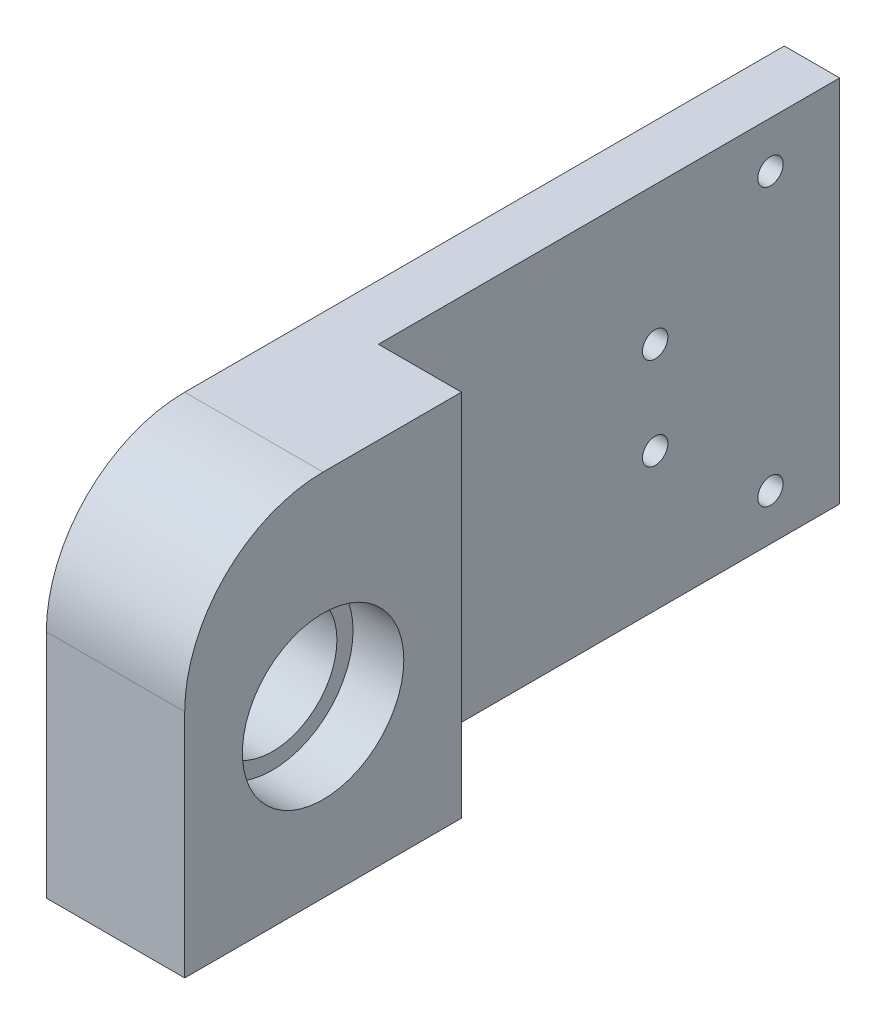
ISO-10303-21;
HEADER;
FILE_DESCRIPTION(('STEP AP214'),'2;1');
FILE_NAME('part.step','',(''),(''),'','','');
FILE_SCHEMA(('AUTOMOTIVE_DESIGN { 1 0 10303 214 1 1 1 1 }'));
ENDSEC;
DATA;
#1=APPLICATION_CONTEXT('core data for automotive mechanical design processes');
#2=APPLICATION_PROTOCOL_DEFINITION('international standard','automotive_design',2000,#1);
#3=PRODUCT_CONTEXT('',#1,'mechanical');
#4=PRODUCT('Part','Part','',(#3));
#5=PRODUCT_RELATED_PRODUCT_CATEGORY('part','',(#4));
#6=PRODUCT_DEFINITION_FORMATION('','',#4);
#7=PRODUCT_DEFINITION_CONTEXT('part definition',#1,'design');
#8=PRODUCT_DEFINITION('design','',#6,#7);
#9=PRODUCT_DEFINITION_SHAPE('','',#8);
#10=(LENGTH_UNIT() NAMED_UNIT(*) SI_UNIT(.MILLI.,.METRE.));
#11=(NAMED_UNIT(*) PLANE_ANGLE_UNIT() SI_UNIT($,.RADIAN.));
#12=(NAMED_UNIT(*) SI_UNIT($,.STERADIAN.) SOLID_ANGLE_UNIT());
#13=UNCERTAINTY_MEASURE_WITH_UNIT(LENGTH_MEASURE(1.E-05),#10,'distance_accuracy_value','');
#14=(GEOMETRIC_REPRESENTATION_CONTEXT(3) GLOBAL_UNCERTAINTY_ASSIGNED_CONTEXT((#13)) GLOBAL_UNIT_ASSIGNED_CONTEXT((#10,
#11,#12)) REPRESENTATION_CONTEXT('',''));
#15=CARTESIAN_POINT('',(0.,0.,0.));
#16=DIRECTION('',(0.,0.,1.));
#17=DIRECTION('',(1.,0.,0.));
#18=AXIS2_PLACEMENT_3D('',#15,#16,#17);
#19=CARTESIAN_POINT('',(0.,-30.,-65.));
#20=DIRECTION('',(1.,0.,0.));
#21=DIRECTION('',(0.,0.,-1.));
#22=AXIS2_PLACEMENT_3D('',#19,#20,#21);
#23=CYLINDRICAL_SURFACE('',#22,2.75000000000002);
#24=CARTESIAN_POINT('',(5.,-30.,-65.));
#25=DIRECTION('',(1.,0.,0.));
#26=DIRECTION('',(0.,0.,-1.));
#27=AXIS2_PLACEMENT_3D('',#24,#25,#26);
#28=CIRCLE('',#27,2.75000000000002);
#29=CARTESIAN_POINT('',(5.,-30.,-67.75));
#30=VERTEX_POINT('',#29);
#31=EDGE_CURVE('E20',#30,#30,#28,.T.);
#32=ORIENTED_EDGE('',*,*,#31,.F.);
#33=EDGE_LOOP('',(#32));
#34=FACE_BOUND('',#33,.T.);
#35=CARTESIAN_POINT('',(12.,-30.,-65.));
#36=DIRECTION('',(1.,0.,0.));
#37=DIRECTION('',(0.,0.,-1.));
#38=AXIS2_PLACEMENT_3D('',#35,#36,#37);
#39=CIRCLE('',#38,2.75000000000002);
#40=CARTESIAN_POINT('',(12.,-30.,-67.75));
#41=VERTEX_POINT('',#40);
#42=EDGE_CURVE('E207',#41,#41,#39,.T.);
#43=ORIENTED_EDGE('',*,*,#42,.T.);
#44=EDGE_LOOP('',(#43));
#45=FACE_BOUND('',#44,.T.);
#46=ADVANCED_FACE('F17',(#34,#45),#23,.F.);
#47=CARTESIAN_POINT('',(0.,-9.99999999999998,-40.));
#48=DIRECTION('',(1.,0.,0.));
#49=DIRECTION('',(0.,0.,-1.));
#50=AXIS2_PLACEMENT_3D('',#47,#48,#49);
#51=CYLINDRICAL_SURFACE('',#50,2.75);
#52=CARTESIAN_POINT('',(5.,-9.99999999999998,-40.));
#53=DIRECTION('',(1.,0.,0.));
#54=DIRECTION('',(0.,0.,-1.));
#55=AXIS2_PLACEMENT_3D('',#52,#53,#54);
#56=CIRCLE('',#55,2.75);
#57=CARTESIAN_POINT('',(5.,-9.99999999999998,-42.75));
#58=VERTEX_POINT('',#57);
#59=EDGE_CURVE('E218',#58,#58,#56,.T.);
#60=ORIENTED_EDGE('',*,*,#59,.F.);
#61=EDGE_LOOP('',(#60));
#62=FACE_BOUND('',#61,.T.);
#63=CARTESIAN_POINT('',(12.,-9.99999999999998,-40.));
#64=DIRECTION('',(1.,0.,0.));
#65=DIRECTION('',(0.,0.,-1.));
#66=AXIS2_PLACEMENT_3D('',#63,#64,#65);
#67=CIRCLE('',#66,2.75);
#68=CARTESIAN_POINT('',(12.,-9.99999999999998,-42.75));
#69=VERTEX_POINT('',#68);
#70=EDGE_CURVE('E204',#69,#69,#67,.T.);
#71=ORIENTED_EDGE('',*,*,#70,.T.);
#72=EDGE_LOOP('',(#71));
#73=FACE_BOUND('',#72,.T.);
#74=ADVANCED_FACE('F230',(#62,#73),#51,.F.);
#75=CARTESIAN_POINT('',(0.,9.99999999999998,-40.));
#76=DIRECTION('',(1.,0.,0.));
#77=DIRECTION('',(0.,0.,-1.));
#78=AXIS2_PLACEMENT_3D('',#75,#76,#77);
#79=CYLINDRICAL_SURFACE('',#78,2.75);
#80=CARTESIAN_POINT('',(5.,9.99999999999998,-40.));
#81=DIRECTION('',(1.,0.,0.));
#82=DIRECTION('',(0.,0.,-1.));
#83=AXIS2_PLACEMENT_3D('',#80,#81,#82);
#84=CIRCLE('',#83,2.75);
#85=CARTESIAN_POINT('',(5.,9.99999999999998,-42.75));
#86=VERTEX_POINT('',#85);
#87=EDGE_CURVE('E216',#86,#86,#84,.T.);
#88=ORIENTED_EDGE('',*,*,#87,.F.);
#89=EDGE_LOOP('',(#88));
#90=FACE_BOUND('',#89,.T.);
#91=CARTESIAN_POINT('',(12.,9.99999999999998,-40.));
#92=DIRECTION('',(1.,0.,0.));
#93=DIRECTION('',(0.,0.,-1.));
#94=AXIS2_PLACEMENT_3D('',#91,#92,#93);
#95=CIRCLE('',#94,2.75);
#96=CARTESIAN_POINT('',(12.,9.99999999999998,-42.75));
#97=VERTEX_POINT('',#96);
#98=EDGE_CURVE('E201',#97,#97,#95,.T.);
#99=ORIENTED_EDGE('',*,*,#98,.T.);
#100=EDGE_LOOP('',(#99));
#101=FACE_BOUND('',#100,.T.);
#102=ADVANCED_FACE('F323',(#90,#101),#79,.F.);
#103=CARTESIAN_POINT('',(0.,30.,-65.));
#104=DIRECTION('',(1.,0.,0.));
#105=DIRECTION('',(0.,0.,-1.));
#106=AXIS2_PLACEMENT_3D('',#103,#104,#105);
#107=CYLINDRICAL_SURFACE('',#106,2.75000000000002);
#108=CARTESIAN_POINT('',(5.,30.,-65.));
#109=DIRECTION('',(1.,0.,0.));
#110=DIRECTION('',(0.,0.,-1.));
#111=AXIS2_PLACEMENT_3D('',#108,#109,#110);
#112=CIRCLE('',#111,2.75000000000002);
#113=CARTESIAN_POINT('',(5.,30.,-67.75));
#114=VERTEX_POINT('',#113);
#115=EDGE_CURVE('E213',#114,#114,#112,.T.);
#116=ORIENTED_EDGE('',*,*,#115,.F.);
#117=EDGE_LOOP('',(#116));
#118=FACE_BOUND('',#117,.T.);
#119=CARTESIAN_POINT('',(12.,30.,-65.));
#120=DIRECTION('',(1.,0.,0.));
#121=DIRECTION('',(0.,0.,-1.));
#122=AXIS2_PLACEMENT_3D('',#119,#120,#121);
#123=CIRCLE('',#122,2.75000000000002);
#124=CARTESIAN_POINT('',(12.,30.,-67.75));
#125=VERTEX_POINT('',#124);
#126=EDGE_CURVE('E152',#125,#125,#123,.T.);
#127=ORIENTED_EDGE('',*,*,#126,.T.);
#128=EDGE_LOOP('',(#127));
#129=FACE_BOUND('',#128,.T.);
#130=ADVANCED_FACE('F311',(#118,#129),#107,.F.);
#131=CARTESIAN_POINT('',(19.,-4.00000000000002,50.));
#132=DIRECTION('',(1.,0.,0.));
#133=DIRECTION('',(0.,0.,-1.));
#134=AXIS2_PLACEMENT_3D('',#131,#132,#133);
#135=CYLINDRICAL_SURFACE('',#134,17.5);
#136=CARTESIAN_POINT('',(30.,-4.00000000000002,50.));
#137=DIRECTION('',(1.,0.,0.));
#138=DIRECTION('',(0.,0.,-1.));
#139=AXIS2_PLACEMENT_3D('',#136,#137,#138);
#140=CIRCLE('',#139,17.5);
#141=CARTESIAN_POINT('',(30.,-4.00000000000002,32.5));
#142=VERTEX_POINT('',#141);
#143=EDGE_CURVE('E145',#142,#142,#140,.F.);
#144=ORIENTED_EDGE('',*,*,#143,.F.);
#145=EDGE_LOOP('',(#144));
#146=FACE_BOUND('',#145,.T.);
#147=CARTESIAN_POINT('',(19.,-4.00000000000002,50.));
#148=DIRECTION('',(1.,0.,0.));
#149=DIRECTION('',(0.,0.,-1.));
#150=AXIS2_PLACEMENT_3D('',#147,#148,#149);
#151=CIRCLE('',#150,17.5);
#152=CARTESIAN_POINT('',(19.,-4.00000000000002,32.5));
#153=VERTEX_POINT('',#152);
#154=EDGE_CURVE('E210',#153,#153,#151,.T.);
#155=ORIENTED_EDGE('',*,*,#154,.F.);
#156=EDGE_LOOP('',(#155));
#157=FACE_BOUND('',#156,.T.);
#158=ADVANCED_FACE('F308',(#146,#157),#135,.F.);
#159=CARTESIAN_POINT('',(5.,-30.,-65.));
#160=DIRECTION('',(-1.,0.,0.));
#161=DIRECTION('',(0.,0.,1.));
#162=AXIS2_PLACEMENT_3D('',#159,#160,#161);
#163=PLANE('',#162);
#164=ORIENTED_EDGE('',*,*,#31,.T.);
#165=EDGE_LOOP('',(#164));
#166=FACE_BOUND('',#165,.T.);
#167=CARTESIAN_POINT('',(5.,-30.,-65.));
#168=DIRECTION('',(-1.,0.,0.));
#169=DIRECTION('',(0.,0.,1.));
#170=AXIS2_PLACEMENT_3D('',#167,#168,#169);
#171=CIRCLE('',#170,5.);
#172=CARTESIAN_POINT('',(5.,-30.,-60.));
#173=VERTEX_POINT('',#172);
#174=EDGE_CURVE('E194',#173,#173,#171,.T.);
#175=ORIENTED_EDGE('',*,*,#174,.T.);
#176=EDGE_LOOP('',(#175));
#177=FACE_BOUND('',#176,.T.);
#178=ADVANCED_FACE('F225',(#166,#177),#163,.T.);
#179=CARTESIAN_POINT('',(5.,-9.99999999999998,-40.));
#180=DIRECTION('',(-1.,0.,0.));
#181=DIRECTION('',(0.,0.,1.));
#182=AXIS2_PLACEMENT_3D('',#179,#180,#181);
#183=PLANE('',#182);
#184=ORIENTED_EDGE('',*,*,#59,.T.);
#185=EDGE_LOOP('',(#184));
#186=FACE_BOUND('',#185,.T.);
#187=CARTESIAN_POINT('',(5.,-9.99999999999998,-40.));
#188=DIRECTION('',(-1.,0.,0.));
#189=DIRECTION('',(0.,0.,1.));
#190=AXIS2_PLACEMENT_3D('',#187,#188,#189);
#191=CIRCLE('',#190,5.);
#192=CARTESIAN_POINT('',(5.,-9.99999999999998,-35.));
#193=VERTEX_POINT('',#192);
#194=EDGE_CURVE('E191',#193,#193,#191,.T.);
#195=ORIENTED_EDGE('',*,*,#194,.T.);
#196=EDGE_LOOP('',(#195));
#197=FACE_BOUND('',#196,.T.);
#198=ADVANCED_FACE('F321',(#186,#197),#183,.T.);
#199=CARTESIAN_POINT('',(5.,9.99999999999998,-40.));
#200=DIRECTION('',(-1.,0.,0.));
#201=DIRECTION('',(0.,0.,1.));
#202=AXIS2_PLACEMENT_3D('',#199,#200,#201);
#203=PLANE('',#202);
#204=ORIENTED_EDGE('',*,*,#87,.T.);
#205=EDGE_LOOP('',(#204));
#206=FACE_BOUND('',#205,.T.);
#207=CARTESIAN_POINT('',(5.,9.99999999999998,-40.));
#208=DIRECTION('',(-1.,0.,0.));
#209=DIRECTION('',(0.,0.,1.));
#210=AXIS2_PLACEMENT_3D('',#207,#208,#209);
#211=CIRCLE('',#210,5.);
#212=CARTESIAN_POINT('',(5.,9.99999999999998,-35.));
#213=VERTEX_POINT('',#212);
#214=EDGE_CURVE('E188',#213,#213,#211,.T.);
#215=ORIENTED_EDGE('',*,*,#214,.T.);
#216=EDGE_LOOP('',(#215));
#217=FACE_BOUND('',#216,.T.);
#218=ADVANCED_FACE('F371',(#206,#217),#203,.T.);
#219=CARTESIAN_POINT('',(5.,30.,-65.));
#220=DIRECTION('',(-1.,0.,0.));
#221=DIRECTION('',(0.,0.,1.));
#222=AXIS2_PLACEMENT_3D('',#219,#220,#221);
#223=PLANE('',#222);
#224=ORIENTED_EDGE('',*,*,#115,.T.);
#225=EDGE_LOOP('',(#224));
#226=FACE_BOUND('',#225,.T.);
#227=CARTESIAN_POINT('',(5.,30.,-65.));
#228=DIRECTION('',(-1.,0.,0.));
#229=DIRECTION('',(0.,0.,1.));
#230=AXIS2_PLACEMENT_3D('',#227,#228,#229);
#231=CIRCLE('',#230,5.);
#232=CARTESIAN_POINT('',(5.,30.,-60.));
#233=VERTEX_POINT('',#232);
#234=EDGE_CURVE('E185',#233,#233,#231,.T.);
#235=ORIENTED_EDGE('',*,*,#234,.T.);
#236=EDGE_LOOP('',(#235));
#237=FACE_BOUND('',#236,.T.);
#238=ADVANCED_FACE('F245',(#226,#237),#223,.T.);
#239=CARTESIAN_POINT('',(19.,-4.00000000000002,50.));
#240=DIRECTION('',(1.,0.,0.));
#241=DIRECTION('',(0.,0.,-1.));
#242=AXIS2_PLACEMENT_3D('',#239,#240,#241);
#243=PLANE('',#242);
#244=ORIENTED_EDGE('',*,*,#154,.T.);
#245=EDGE_LOOP('',(#244));
#246=FACE_BOUND('',#245,.T.);
#247=CARTESIAN_POINT('',(19.,-4.00000000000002,50.));
#248=DIRECTION('',(1.,0.,0.));
#249=DIRECTION('',(0.,0.,-1.));
#250=AXIS2_PLACEMENT_3D('',#247,#248,#249);
#251=CIRCLE('',#250,14.);
#252=CARTESIAN_POINT('',(19.,-4.00000000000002,36.));
#253=VERTEX_POINT('',#252);
#254=EDGE_CURVE('E135',#253,#253,#251,.F.);
#255=ORIENTED_EDGE('',*,*,#254,.T.);
#256=EDGE_LOOP('',(#255));
#257=FACE_BOUND('',#256,.T.);
#258=ADVANCED_FACE('F236',(#246,#257),#243,.T.);
#259=CARTESIAN_POINT('',(12.,-40.,-80.));
#260=DIRECTION('',(-1.,0.,0.));
#261=DIRECTION('',(0.,0.,1.));
#262=AXIS2_PLACEMENT_3D('',#259,#260,#261);
#263=PLANE('',#262);
#264=DIRECTION('',(0.,1.,0.));
#265=VECTOR('',#264,1.);
#266=CARTESIAN_POINT('',(12.,-40.,20.));
#267=LINE('',#266,#265);
#268=CARTESIAN_POINT('',(12.,40.,20.));
#269=VERTEX_POINT('',#268);
#270=CARTESIAN_POINT('',(12.,-40.,20.));
#271=VERTEX_POINT('',#270);
#272=EDGE_CURVE('E78',#269,#271,#267,.F.);
#273=ORIENTED_EDGE('',*,*,#272,.T.);
#274=DIRECTION('',(0.,0.,1.));
#275=VECTOR('',#274,1.);
#276=CARTESIAN_POINT('',(12.,-40.,79.9999999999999));
#277=LINE('',#276,#275);
#278=CARTESIAN_POINT('',(12.,-40.,-80.));
#279=VERTEX_POINT('',#278);
#280=EDGE_CURVE('E125',#271,#279,#277,.F.);
#281=ORIENTED_EDGE('',*,*,#280,.T.);
#282=DIRECTION('',(0.,-1.,0.));
#283=VECTOR('',#282,1.);
#284=CARTESIAN_POINT('',(12.,40.,-80.));
#285=LINE('',#284,#283);
#286=CARTESIAN_POINT('',(12.,40.,-80.));
#287=VERTEX_POINT('',#286);
#288=EDGE_CURVE('E86',#279,#287,#285,.F.);
#289=ORIENTED_EDGE('',*,*,#288,.T.);
#290=DIRECTION('',(0.,0.,-1.));
#291=VECTOR('',#290,1.);
#292=CARTESIAN_POINT('',(12.,40.,80.));
#293=LINE('',#292,#291);
#294=EDGE_CURVE('E104',#287,#269,#293,.F.);
#295=ORIENTED_EDGE('',*,*,#294,.T.);
#296=EDGE_LOOP('',(#273,#281,#289,#295));
#297=FACE_BOUND('',#296,.T.);
#298=ORIENTED_EDGE('',*,*,#126,.F.);
#299=EDGE_LOOP('',(#298));
#300=FACE_BOUND('',#299,.T.);
#301=ORIENTED_EDGE('',*,*,#98,.F.);
#302=EDGE_LOOP('',(#301));
#303=FACE_BOUND('',#302,.T.);
#304=ORIENTED_EDGE('',*,*,#70,.F.);
#305=EDGE_LOOP('',(#304));
#306=FACE_BOUND('',#305,.T.);
#307=ORIENTED_EDGE('',*,*,#42,.F.);
#308=EDGE_LOOP('',(#307));
#309=FACE_BOUND('',#308,.T.);
#310=ADVANCED_FACE('F233',(#297,#300,#303,#306,#309),#263,.F.);
#311=CARTESIAN_POINT('',(30.,-40.,20.));
#312=DIRECTION('',(0.,0.,1.));
#313=DIRECTION('',(1.,0.,0.));
#314=AXIS2_PLACEMENT_3D('',#311,#312,#313);
#315=PLANE('',#314);
#316=DIRECTION('',(0.,1.,0.));
#317=VECTOR('',#316,1.);
#318=CARTESIAN_POINT('',(30.,0.,20.));
#319=LINE('',#318,#317);
#320=CARTESIAN_POINT('',(30.,-40.,20.));
#321=VERTEX_POINT('',#320);
#322=CARTESIAN_POINT('',(30.,40.,20.));
#323=VERTEX_POINT('',#322);
#324=EDGE_CURVE('E143',#321,#323,#319,.T.);
#325=ORIENTED_EDGE('',*,*,#324,.F.);
#326=DIRECTION('',(1.,0.,0.));
#327=VECTOR('',#326,1.);
#328=CARTESIAN_POINT('',(30.,-40.,20.));
#329=LINE('',#328,#327);
#330=EDGE_CURVE('E134',#321,#271,#329,.F.);
#331=ORIENTED_EDGE('',*,*,#330,.T.);
#332=ORIENTED_EDGE('',*,*,#272,.F.);
#333=DIRECTION('',(1.,0.,0.));
#334=VECTOR('',#333,1.);
#335=CARTESIAN_POINT('',(30.,40.,20.));
#336=LINE('',#335,#334);
#337=EDGE_CURVE('E140',#269,#323,#336,.T.);
#338=ORIENTED_EDGE('',*,*,#337,.T.);
#339=EDGE_LOOP('',(#325,#331,#332,#338));
#340=FACE_BOUND('',#339,.T.);
#341=ADVANCED_FACE('F235',(#340),#315,.F.);
#342=CARTESIAN_POINT('',(30.,0.,0.));
#343=DIRECTION('',(1.,0.,0.));
#344=DIRECTION('',(0.,0.,-1.));
#345=AXIS2_PLACEMENT_3D('',#342,#343,#344);
#346=PLANE('',#345);
#347=ORIENTED_EDGE('',*,*,#143,.T.);
#348=EDGE_LOOP('',(#347));
#349=FACE_BOUND('',#348,.T.);
#350=DIRECTION('',(0.,0.,1.));
#351=VECTOR('',#350,1.);
#352=CARTESIAN_POINT('',(30.,-40.,79.9999999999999));
#353=LINE('',#352,#351);
#354=CARTESIAN_POINT('',(30.,-40.,79.9999999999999));
#355=VERTEX_POINT('',#354);
#356=EDGE_CURVE('E58',#355,#321,#353,.F.);
#357=ORIENTED_EDGE('',*,*,#356,.T.);
#358=ORIENTED_EDGE('',*,*,#324,.T.);
#359=DIRECTION('',(0.,0.,-1.));
#360=VECTOR('',#359,1.);
#361=CARTESIAN_POINT('',(30.,40.,80.));
#362=LINE('',#361,#360);
#363=CARTESIAN_POINT('',(30.,40.,50.));
#364=VERTEX_POINT('',#363);
#365=EDGE_CURVE('E138',#323,#364,#362,.F.);
#366=ORIENTED_EDGE('',*,*,#365,.T.);
#367=CARTESIAN_POINT('',(30.,9.99999999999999,50.));
#368=DIRECTION('',(-1.,0.,0.));
#369=DIRECTION('',(0.,0.,1.));
#370=AXIS2_PLACEMENT_3D('',#367,#368,#369);
#371=CIRCLE('',#370,30.);
#372=CARTESIAN_POINT('',(30.,9.99999999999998,80.));
#373=VERTEX_POINT('',#372);
#374=EDGE_CURVE('E48',#373,#364,#371,.T.);
#375=ORIENTED_EDGE('',*,*,#374,.F.);
#376=DIRECTION('',(0.,1.,0.));
#377=VECTOR('',#376,1.);
#378=CARTESIAN_POINT('',(30.,40.,80.));
#379=LINE('',#378,#377);
#380=EDGE_CURVE('E128',#373,#355,#379,.F.);
#381=ORIENTED_EDGE('',*,*,#380,.T.);
#382=EDGE_LOOP('',(#357,#358,#366,#375,#381));
#383=FACE_BOUND('',#382,.T.);
#384=ADVANCED_FACE('F243',(#349,#383),#346,.T.);
#385=CARTESIAN_POINT('',(5.,-30.,-65.));
#386=DIRECTION('',(-1.,0.,0.));
#387=DIRECTION('',(0.,0.,1.));
#388=AXIS2_PLACEMENT_3D('',#385,#386,#387);
#389=CYLINDRICAL_SURFACE('',#388,5.);
#390=ORIENTED_EDGE('',*,*,#174,.F.);
#391=EDGE_LOOP('',(#390));
#392=FACE_BOUND('',#391,.T.);
#393=CARTESIAN_POINT('',(0.,-30.,-65.));
#394=DIRECTION('',(-1.,0.,0.));
#395=DIRECTION('',(0.,0.,1.));
#396=AXIS2_PLACEMENT_3D('',#393,#394,#395);
#397=CIRCLE('',#396,5.);
#398=CARTESIAN_POINT('',(0.,-30.,-60.));
#399=VERTEX_POINT('',#398);
#400=EDGE_CURVE('E130',#399,#399,#397,.T.);
#401=ORIENTED_EDGE('',*,*,#400,.T.);
#402=EDGE_LOOP('',(#401));
#403=FACE_BOUND('',#402,.T.);
#404=ADVANCED_FACE('F283',(#392,#403),#389,.F.);
#405=CARTESIAN_POINT('',(5.,-9.99999999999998,-40.));
#406=DIRECTION('',(-1.,0.,0.));
#407=DIRECTION('',(0.,0.,1.));
#408=AXIS2_PLACEMENT_3D('',#405,#406,#407);
#409=CYLINDRICAL_SURFACE('',#408,5.);
#410=ORIENTED_EDGE('',*,*,#194,.F.);
#411=EDGE_LOOP('',(#410));
#412=FACE_BOUND('',#411,.T.);
#413=CARTESIAN_POINT('',(0.,-9.99999999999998,-40.));
#414=DIRECTION('',(-1.,0.,0.));
#415=DIRECTION('',(0.,0.,1.));
#416=AXIS2_PLACEMENT_3D('',#413,#414,#415);
#417=CIRCLE('',#416,5.);
#418=CARTESIAN_POINT('',(0.,-9.99999999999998,-35.));
#419=VERTEX_POINT('',#418);
#420=EDGE_CURVE('E176',#419,#419,#417,.T.);
#421=ORIENTED_EDGE('',*,*,#420,.T.);
#422=EDGE_LOOP('',(#421));
#423=FACE_BOUND('',#422,.T.);
#424=ADVANCED_FACE('F279',(#412,#423),#409,.F.);
#425=CARTESIAN_POINT('',(5.,9.99999999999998,-40.));
#426=DIRECTION('',(-1.,0.,0.));
#427=DIRECTION('',(0.,0.,1.));
#428=AXIS2_PLACEMENT_3D('',#425,#426,#427);
#429=CYLINDRICAL_SURFACE('',#428,5.);
#430=ORIENTED_EDGE('',*,*,#214,.F.);
#431=EDGE_LOOP('',(#430));
#432=FACE_BOUND('',#431,.T.);
#433=CARTESIAN_POINT('',(0.,9.99999999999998,-40.));
#434=DIRECTION('',(-1.,0.,0.));
#435=DIRECTION('',(0.,0.,1.));
#436=AXIS2_PLACEMENT_3D('',#433,#434,#435);
#437=CIRCLE('',#436,5.);
#438=CARTESIAN_POINT('',(0.,9.99999999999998,-35.));
#439=VERTEX_POINT('',#438);
#440=EDGE_CURVE('E173',#439,#439,#437,.T.);
#441=ORIENTED_EDGE('',*,*,#440,.T.);
#442=EDGE_LOOP('',(#441));
#443=FACE_BOUND('',#442,.T.);
#444=ADVANCED_FACE('F275',(#432,#443),#429,.F.);
#445=CARTESIAN_POINT('',(5.,30.,-65.));
#446=DIRECTION('',(-1.,0.,0.));
#447=DIRECTION('',(0.,0.,1.));
#448=AXIS2_PLACEMENT_3D('',#445,#446,#447);
#449=CYLINDRICAL_SURFACE('',#448,5.);
#450=ORIENTED_EDGE('',*,*,#234,.F.);
#451=EDGE_LOOP('',(#450));
#452=FACE_BOUND('',#451,.T.);
#453=CARTESIAN_POINT('',(0.,30.,-65.));
#454=DIRECTION('',(-1.,0.,0.));
#455=DIRECTION('',(0.,0.,1.));
#456=AXIS2_PLACEMENT_3D('',#453,#454,#455);
#457=CIRCLE('',#456,5.);
#458=CARTESIAN_POINT('',(0.,30.,-60.));
#459=VERTEX_POINT('',#458);
#460=EDGE_CURVE('E170',#459,#459,#457,.T.);
#461=ORIENTED_EDGE('',*,*,#460,.T.);
#462=EDGE_LOOP('',(#461));
#463=FACE_BOUND('',#462,.T.);
#464=ADVANCED_FACE('F271',(#452,#463),#449,.F.);
#465=CARTESIAN_POINT('',(0.,-4.00000000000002,50.));
#466=DIRECTION('',(1.,0.,0.));
#467=DIRECTION('',(0.,0.,-1.));
#468=AXIS2_PLACEMENT_3D('',#465,#466,#467);
#469=CYLINDRICAL_SURFACE('',#468,14.);
#470=CARTESIAN_POINT('',(0.,-4.00000000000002,50.));
#471=DIRECTION('',(1.,0.,0.));
#472=DIRECTION('',(0.,0.,-1.));
#473=AXIS2_PLACEMENT_3D('',#470,#471,#472);
#474=CIRCLE('',#473,14.);
#475=CARTESIAN_POINT('',(0.,-4.00000000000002,36.));
#476=VERTEX_POINT('',#475);
#477=EDGE_CURVE('E117',#476,#476,#474,.F.);
#478=ORIENTED_EDGE('',*,*,#477,.T.);
#479=EDGE_LOOP('',(#478));
#480=FACE_BOUND('',#479,.T.);
#481=ORIENTED_EDGE('',*,*,#254,.F.);
#482=EDGE_LOOP('',(#481));
#483=FACE_BOUND('',#482,.T.);
#484=ADVANCED_FACE('F268',(#480,#483),#469,.F.);
#485=CARTESIAN_POINT('',(30.,-40.,79.9999999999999));
#486=DIRECTION('',(0.,1.,0.));
#487=DIRECTION('',(0.,0.,1.));
#488=AXIS2_PLACEMENT_3D('',#485,#486,#487);
#489=PLANE('',#488);
#490=ORIENTED_EDGE('',*,*,#330,.F.);
#491=ORIENTED_EDGE('',*,*,#356,.F.);
#492=DIRECTION('',(1.,0.,0.));
#493=VECTOR('',#492,1.);
#494=CARTESIAN_POINT('',(30.,-40.,79.9999999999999));
#495=LINE('',#494,#493);
#496=CARTESIAN_POINT('',(0.,-40.,80.));
#497=VERTEX_POINT('',#496);
#498=EDGE_CURVE('E294',#355,#497,#495,.F.);
#499=ORIENTED_EDGE('',*,*,#498,.T.);
#500=DIRECTION('',(0.,0.,-1.));
#501=VECTOR('',#500,1.);
#502=CARTESIAN_POINT('',(0.,-40.,0.));
#503=LINE('',#502,#501);
#504=CARTESIAN_POINT('',(0.,-40.,-80.));
#505=VERTEX_POINT('',#504);
#506=EDGE_CURVE('E115',#497,#505,#503,.T.);
#507=ORIENTED_EDGE('',*,*,#506,.T.);
#508=DIRECTION('',(1.,0.,0.));
#509=VECTOR('',#508,1.);
#510=CARTESIAN_POINT('',(30.,-40.,-80.));
#511=LINE('',#510,#509);
#512=EDGE_CURVE('E93',#505,#279,#511,.T.);
#513=ORIENTED_EDGE('',*,*,#512,.T.);
#514=ORIENTED_EDGE('',*,*,#280,.F.);
#515=EDGE_LOOP('',(#490,#491,#499,#507,#513,#514));
#516=FACE_BOUND('',#515,.T.);
#517=ADVANCED_FACE('F265',(#516),#489,.F.);
#518=CARTESIAN_POINT('',(30.,40.,-80.));
#519=DIRECTION('',(0.,0.,1.));
#520=DIRECTION('',(0.,-1.,0.));
#521=AXIS2_PLACEMENT_3D('',#518,#519,#520);
#522=PLANE('',#521);
#523=ORIENTED_EDGE('',*,*,#288,.F.);
#524=ORIENTED_EDGE('',*,*,#512,.F.);
#525=DIRECTION('',(0.,1.,0.));
#526=VECTOR('',#525,1.);
#527=CARTESIAN_POINT('',(0.,0.,-80.));
#528=LINE('',#527,#526);
#529=CARTESIAN_POINT('',(0.,40.,-80.));
#530=VERTEX_POINT('',#529);
#531=EDGE_CURVE('E110',#505,#530,#528,.T.);
#532=ORIENTED_EDGE('',*,*,#531,.T.);
#533=DIRECTION('',(1.,0.,0.));
#534=VECTOR('',#533,1.);
#535=CARTESIAN_POINT('',(30.,40.,-80.));
#536=LINE('',#535,#534);
#537=EDGE_CURVE('E99',#530,#287,#536,.T.);
#538=ORIENTED_EDGE('',*,*,#537,.T.);
#539=EDGE_LOOP('',(#523,#524,#532,#538));
#540=FACE_BOUND('',#539,.T.);
#541=ADVANCED_FACE('F114',(#540),#522,.F.);
#542=CARTESIAN_POINT('',(30.,40.,80.));
#543=DIRECTION('',(0.,-1.,0.));
#544=DIRECTION('',(0.,0.,-1.));
#545=AXIS2_PLACEMENT_3D('',#542,#543,#544);
#546=PLANE('',#545);
#547=DIRECTION('',(-1.,0.,0.));
#548=VECTOR('',#547,1.);
#549=CARTESIAN_POINT('',(30.,40.,50.));
#550=LINE('',#549,#548);
#551=CARTESIAN_POINT('',(0.,40.,50.));
#552=VERTEX_POINT('',#551);
#553=EDGE_CURVE('E182',#364,#552,#550,.T.);
#554=ORIENTED_EDGE('',*,*,#553,.F.);
#555=ORIENTED_EDGE('',*,*,#365,.F.);
#556=ORIENTED_EDGE('',*,*,#337,.F.);
#557=ORIENTED_EDGE('',*,*,#294,.F.);
#558=ORIENTED_EDGE('',*,*,#537,.F.);
#559=DIRECTION('',(0.,0.,-1.));
#560=VECTOR('',#559,1.);
#561=CARTESIAN_POINT('',(0.,40.,0.));
#562=LINE('',#561,#560);
#563=EDGE_CURVE('E103',#530,#552,#562,.F.);
#564=ORIENTED_EDGE('',*,*,#563,.T.);
#565=EDGE_LOOP('',(#554,#555,#556,#557,#558,#564));
#566=FACE_BOUND('',#565,.T.);
#567=ADVANCED_FACE('F102',(#566),#546,.F.);
#568=CARTESIAN_POINT('',(30.,9.99999999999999,50.));
#569=DIRECTION('',(-1.,0.,0.));
#570=DIRECTION('',(0.,0.,1.));
#571=AXIS2_PLACEMENT_3D('',#568,#569,#570);
#572=CYLINDRICAL_SURFACE('',#571,30.);
#573=CARTESIAN_POINT('',(0.,9.99999999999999,50.));
#574=DIRECTION('',(-1.,0.,0.));
#575=DIRECTION('',(0.,0.,1.));
#576=AXIS2_PLACEMENT_3D('',#573,#574,#575);
#577=CIRCLE('',#576,30.);
#578=CARTESIAN_POINT('',(0.,9.99999999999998,80.));
#579=VERTEX_POINT('',#578);
#580=EDGE_CURVE('E26',#552,#579,#577,.F.);
#581=ORIENTED_EDGE('',*,*,#580,.T.);
#582=DIRECTION('',(1.,0.,0.));
#583=VECTOR('',#582,1.);
#584=CARTESIAN_POINT('',(30.,9.99999999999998,80.));
#585=LINE('',#584,#583);
#586=EDGE_CURVE('E34',#579,#373,#585,.T.);
#587=ORIENTED_EDGE('',*,*,#586,.T.);
#588=ORIENTED_EDGE('',*,*,#374,.T.);
#589=ORIENTED_EDGE('',*,*,#553,.T.);
#590=EDGE_LOOP('',(#581,#587,#588,#589));
#591=FACE_BOUND('',#590,.T.);
#592=ADVANCED_FACE('F255',(#591),#572,.T.);
#593=CARTESIAN_POINT('',(30.,40.,80.));
#594=DIRECTION('',(0.,0.,-1.));
#595=DIRECTION('',(0.,1.,0.));
#596=AXIS2_PLACEMENT_3D('',#593,#594,#595);
#597=PLANE('',#596);
#598=ORIENTED_EDGE('',*,*,#586,.F.);
#599=DIRECTION('',(0.,1.,0.));
#600=VECTOR('',#599,1.);
#601=CARTESIAN_POINT('',(0.,0.,80.));
#602=LINE('',#601,#600);
#603=EDGE_CURVE('E11',#579,#497,#602,.F.);
#604=ORIENTED_EDGE('',*,*,#603,.T.);
#605=ORIENTED_EDGE('',*,*,#498,.F.);
#606=ORIENTED_EDGE('',*,*,#380,.F.);
#607=EDGE_LOOP('',(#598,#604,#605,#606));
#608=FACE_BOUND('',#607,.T.);
#609=ADVANCED_FACE('F250',(#608),#597,.F.);
#610=CARTESIAN_POINT('',(0.,0.,0.));
#611=DIRECTION('',(1.,0.,0.));
#612=DIRECTION('',(0.,0.,-1.));
#613=AXIS2_PLACEMENT_3D('',#610,#611,#612);
#614=PLANE('',#613);
#615=ORIENTED_EDGE('',*,*,#580,.F.);
#616=ORIENTED_EDGE('',*,*,#563,.F.);
#617=ORIENTED_EDGE('',*,*,#531,.F.);
#618=ORIENTED_EDGE('',*,*,#506,.F.);
#619=ORIENTED_EDGE('',*,*,#603,.F.);
#620=EDGE_LOOP('',(#615,#616,#617,#618,#619));
#621=FACE_BOUND('',#620,.T.);
#622=ORIENTED_EDGE('',*,*,#477,.F.);
#623=EDGE_LOOP('',(#622));
#624=FACE_BOUND('',#623,.T.);
#625=ORIENTED_EDGE('',*,*,#460,.F.);
#626=EDGE_LOOP('',(#625));
#627=FACE_BOUND('',#626,.T.);
#628=ORIENTED_EDGE('',*,*,#440,.F.);
#629=EDGE_LOOP('',(#628));
#630=FACE_BOUND('',#629,.T.);
#631=ORIENTED_EDGE('',*,*,#420,.F.);
#632=EDGE_LOOP('',(#631));
#633=FACE_BOUND('',#632,.T.);
#634=ORIENTED_EDGE('',*,*,#400,.F.);
#635=EDGE_LOOP('',(#634));
#636=FACE_BOUND('',#635,.T.);
#637=ADVANCED_FACE('F108',(#621,#624,#627,#630,#633,#636),#614,.F.);
#638=CLOSED_SHELL('',(#46,#74,#102,#130,#158,#178,#198,#218,#238,#258,#310,#341,#384,#404,#424,
#444,#464,#484,#517,#541,#567,#592,#609,#637));
#639=MANIFOLD_SOLID_BREP('B1',#638);
#640=ADVANCED_BREP_SHAPE_REPRESENTATION('',(#18,#639),#14);
#641=SHAPE_DEFINITION_REPRESENTATION(#9,#640);
ENDSEC;
END-ISO-10303-21;
